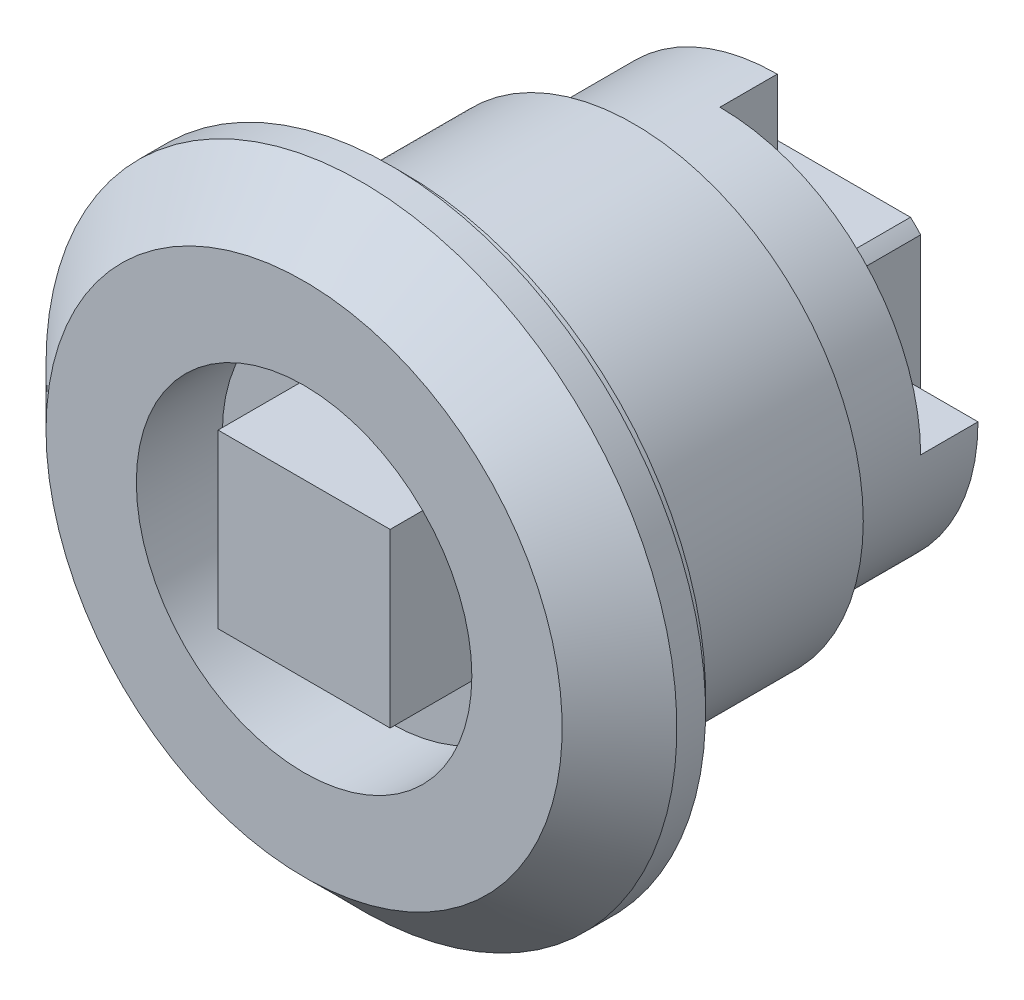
ISO-10303-21;
HEADER;
FILE_DESCRIPTION(('STEP AP214'),'2;1');
FILE_NAME('part.step','',(''),(''),'','','');
FILE_SCHEMA(('AUTOMOTIVE_DESIGN { 1 0 10303 214 1 1 1 1 }'));
ENDSEC;
DATA;
#1=APPLICATION_CONTEXT('core data for automotive mechanical design processes');
#2=APPLICATION_PROTOCOL_DEFINITION('international standard','automotive_design',2000,#1);
#3=PRODUCT_CONTEXT('',#1,'mechanical');
#4=PRODUCT('Part','Part','',(#3));
#5=PRODUCT_RELATED_PRODUCT_CATEGORY('part','',(#4));
#6=PRODUCT_DEFINITION_FORMATION('','',#4);
#7=PRODUCT_DEFINITION_CONTEXT('part definition',#1,'design');
#8=PRODUCT_DEFINITION('design','',#6,#7);
#9=PRODUCT_DEFINITION_SHAPE('','',#8);
#10=(LENGTH_UNIT() NAMED_UNIT(*) SI_UNIT(.MILLI.,.METRE.));
#11=(NAMED_UNIT(*) PLANE_ANGLE_UNIT() SI_UNIT($,.RADIAN.));
#12=(NAMED_UNIT(*) SI_UNIT($,.STERADIAN.) SOLID_ANGLE_UNIT());
#13=UNCERTAINTY_MEASURE_WITH_UNIT(LENGTH_MEASURE(1.E-05),#10,'distance_accuracy_value','');
#14=(GEOMETRIC_REPRESENTATION_CONTEXT(3) GLOBAL_UNCERTAINTY_ASSIGNED_CONTEXT((#13)) GLOBAL_UNIT_ASSIGNED_CONTEXT((#10,
#11,#12)) REPRESENTATION_CONTEXT('',''));
#15=CARTESIAN_POINT('',(0.,0.,0.));
#16=DIRECTION('',(0.,0.,1.));
#17=DIRECTION('',(1.,0.,0.));
#18=AXIS2_PLACEMENT_3D('',#15,#16,#17);
#19=CARTESIAN_POINT('',(0.,0.,-50.));
#20=DIRECTION('',(0.,0.,-1.));
#21=DIRECTION('',(-1.,0.,0.));
#22=AXIS2_PLACEMENT_3D('',#19,#20,#21);
#23=CYLINDRICAL_SURFACE('',#22,4.);
#24=DIRECTION('',(0.,0.,-1.));
#25=VECTOR('',#24,1.);
#26=CARTESIAN_POINT('',(-2.64575131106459,-3.,-7.61483519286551));
#27=LINE('',#26,#25);
#28=CARTESIAN_POINT('',(-2.64575131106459,-3.,-13.));
#29=VERTEX_POINT('',#28);
#30=CARTESIAN_POINT('',(-2.64575131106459,-3.,-15.));
#31=VERTEX_POINT('',#30);
#32=EDGE_CURVE('E204',#29,#31,#27,.T.);
#33=ORIENTED_EDGE('',*,*,#32,.F.);
#34=CARTESIAN_POINT('',(0.,0.,-13.));
#35=DIRECTION('',(0.,0.,-1.));
#36=DIRECTION('',(-1.,0.,0.));
#37=AXIS2_PLACEMENT_3D('',#34,#35,#36);
#38=CIRCLE('',#37,4.);
#39=CARTESIAN_POINT('',(-3.,-2.6457513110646,-13.));
#40=VERTEX_POINT('',#39);
#41=EDGE_CURVE('E264',#29,#40,#38,.T.);
#42=ORIENTED_EDGE('',*,*,#41,.T.);
#43=DIRECTION('',(0.,0.,-1.));
#44=VECTOR('',#43,1.);
#45=CARTESIAN_POINT('',(-3.,-2.6457513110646,-7.61483519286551));
#46=LINE('',#45,#44);
#47=CARTESIAN_POINT('',(-3.,-2.6457513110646,-15.));
#48=VERTEX_POINT('',#47);
#49=EDGE_CURVE('E229',#40,#48,#46,.T.);
#50=ORIENTED_EDGE('',*,*,#49,.T.);
#51=CARTESIAN_POINT('',(0.,0.,-15.));
#52=DIRECTION('',(0.,0.,-1.));
#53=DIRECTION('',(-1.,0.,0.));
#54=AXIS2_PLACEMENT_3D('',#51,#52,#53);
#55=CIRCLE('',#54,4.);
#56=EDGE_CURVE('E258',#31,#48,#55,.T.);
#57=ORIENTED_EDGE('',*,*,#56,.F.);
#58=EDGE_LOOP('',(#33,#42,#50,#57));
#59=FACE_BOUND('',#58,.T.);
#60=ADVANCED_FACE('F14',(#59),#23,.T.);
#61=DIRECTION('',(0.,0.,-1.));
#62=VECTOR('',#61,1.);
#63=CARTESIAN_POINT('',(2.64575131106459,-3.,-7.61483519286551));
#64=LINE('',#63,#62);
#65=CARTESIAN_POINT('',(2.64575131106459,-3.,-13.));
#66=VERTEX_POINT('',#65);
#67=CARTESIAN_POINT('',(2.64575131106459,-3.,-15.));
#68=VERTEX_POINT('',#67);
#69=EDGE_CURVE('E209',#66,#68,#64,.T.);
#70=ORIENTED_EDGE('',*,*,#69,.T.);
#71=CARTESIAN_POINT('',(3.,-2.64575131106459,-15.));
#72=VERTEX_POINT('',#71);
#73=EDGE_CURVE('E254',#72,#68,#55,.T.);
#74=ORIENTED_EDGE('',*,*,#73,.F.);
#75=DIRECTION('',(0.,0.,-1.));
#76=VECTOR('',#75,1.);
#77=CARTESIAN_POINT('',(3.,-2.64575131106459,-7.61483519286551));
#78=LINE('',#77,#76);
#79=CARTESIAN_POINT('',(3.,-2.64575131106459,-13.));
#80=VERTEX_POINT('',#79);
#81=EDGE_CURVE('E234',#80,#72,#78,.T.);
#82=ORIENTED_EDGE('',*,*,#81,.F.);
#83=EDGE_CURVE('E260',#80,#66,#38,.T.);
#84=ORIENTED_EDGE('',*,*,#83,.T.);
#85=EDGE_LOOP('',(#70,#74,#82,#84));
#86=FACE_BOUND('',#85,.T.);
#87=ADVANCED_FACE('F295',(#86),#23,.T.);
#88=CARTESIAN_POINT('',(0.,4.,-15.));
#89=DIRECTION('',(0.,0.,1.));
#90=DIRECTION('',(1.,0.,0.));
#91=AXIS2_PLACEMENT_3D('',#88,#89,#90);
#92=PLANE('',#91);
#93=CARTESIAN_POINT('',(0.,0.,-15.));
#94=DIRECTION('',(0.,0.,-1.));
#95=DIRECTION('',(-1.,0.,0.));
#96=AXIS2_PLACEMENT_3D('',#93,#94,#95);
#97=CIRCLE('',#96,2.5);
#98=CARTESIAN_POINT('',(-2.5,0.,-15.));
#99=VERTEX_POINT('',#98);
#100=EDGE_CURVE('E198',#99,#99,#97,.T.);
#101=ORIENTED_EDGE('',*,*,#100,.F.);
#102=EDGE_LOOP('',(#101));
#103=FACE_BOUND('',#102,.T.);
#104=DIRECTION('',(-1.,0.,0.));
#105=VECTOR('',#104,1.);
#106=CARTESIAN_POINT('',(2.64575131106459,-3.,-15.));
#107=LINE('',#106,#105);
#108=EDGE_CURVE('E205',#68,#31,#107,.T.);
#109=ORIENTED_EDGE('',*,*,#108,.T.);
#110=ORIENTED_EDGE('',*,*,#56,.T.);
#111=DIRECTION('',(0.,-1.,0.));
#112=VECTOR('',#111,1.);
#113=CARTESIAN_POINT('',(-3.,2.64575131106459,-15.));
#114=LINE('',#113,#112);
#115=CARTESIAN_POINT('',(-3.,2.64575131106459,-15.));
#116=VERTEX_POINT('',#115);
#117=EDGE_CURVE('E223',#116,#48,#114,.T.);
#118=ORIENTED_EDGE('',*,*,#117,.F.);
#119=CARTESIAN_POINT('',(-2.64575131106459,3.,-15.));
#120=VERTEX_POINT('',#119);
#121=EDGE_CURVE('E259',#116,#120,#55,.T.);
#122=ORIENTED_EDGE('',*,*,#121,.T.);
#123=DIRECTION('',(-1.,0.,0.));
#124=VECTOR('',#123,1.);
#125=CARTESIAN_POINT('',(2.64575131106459,3.,-15.));
#126=LINE('',#125,#124);
#127=CARTESIAN_POINT('',(2.64575131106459,3.,-15.));
#128=VERTEX_POINT('',#127);
#129=EDGE_CURVE('E211',#128,#120,#126,.T.);
#130=ORIENTED_EDGE('',*,*,#129,.F.);
#131=CARTESIAN_POINT('',(3.,2.64575131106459,-15.));
#132=VERTEX_POINT('',#131);
#133=EDGE_CURVE('E253',#128,#132,#55,.T.);
#134=ORIENTED_EDGE('',*,*,#133,.T.);
#135=DIRECTION('',(0.,-1.,0.));
#136=VECTOR('',#135,1.);
#137=CARTESIAN_POINT('',(3.,2.64575131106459,-15.));
#138=LINE('',#137,#136);
#139=EDGE_CURVE('E235',#132,#72,#138,.T.);
#140=ORIENTED_EDGE('',*,*,#139,.T.);
#141=ORIENTED_EDGE('',*,*,#73,.T.);
#142=EDGE_LOOP('',(#109,#110,#118,#122,#130,#134,#140,#141));
#143=FACE_BOUND('',#142,.T.);
#144=ADVANCED_FACE('F302',(#103,#143),#92,.F.);
#145=CARTESIAN_POINT('',(-3.,2.64575131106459,-13.));
#146=VERTEX_POINT('',#145);
#147=CARTESIAN_POINT('',(-2.64575131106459,3.,-13.));
#148=VERTEX_POINT('',#147);
#149=EDGE_CURVE('E257',#146,#148,#38,.T.);
#150=ORIENTED_EDGE('',*,*,#149,.T.);
#151=DIRECTION('',(0.,0.,-1.));
#152=VECTOR('',#151,1.);
#153=CARTESIAN_POINT('',(-2.64575131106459,3.,-7.61483519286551));
#154=LINE('',#153,#152);
#155=EDGE_CURVE('E218',#148,#120,#154,.T.);
#156=ORIENTED_EDGE('',*,*,#155,.T.);
#157=ORIENTED_EDGE('',*,*,#121,.F.);
#158=DIRECTION('',(0.,0.,-1.));
#159=VECTOR('',#158,1.);
#160=CARTESIAN_POINT('',(-3.,2.64575131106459,-7.61483519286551));
#161=LINE('',#160,#159);
#162=EDGE_CURVE('E232',#146,#116,#161,.T.);
#163=ORIENTED_EDGE('',*,*,#162,.F.);
#164=EDGE_LOOP('',(#150,#156,#157,#163));
#165=FACE_BOUND('',#164,.T.);
#166=ADVANCED_FACE('F304',(#165),#23,.T.);
#167=ORIENTED_EDGE('',*,*,#133,.F.);
#168=DIRECTION('',(0.,0.,-1.));
#169=VECTOR('',#168,1.);
#170=CARTESIAN_POINT('',(2.64575131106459,3.,-7.61483519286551));
#171=LINE('',#170,#169);
#172=CARTESIAN_POINT('',(2.64575131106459,3.,-13.));
#173=VERTEX_POINT('',#172);
#174=EDGE_CURVE('E221',#173,#128,#171,.T.);
#175=ORIENTED_EDGE('',*,*,#174,.F.);
#176=CARTESIAN_POINT('',(0.,0.,-13.));
#177=DIRECTION('',(0.,0.,-1.));
#178=DIRECTION('',(-1.,0.,0.));
#179=AXIS2_PLACEMENT_3D('',#176,#177,#178);
#180=CIRCLE('',#179,4.);
#181=CARTESIAN_POINT('',(0.,4.,-13.));
#182=VERTEX_POINT('',#181);
#183=EDGE_CURVE('E176',#182,#173,#180,.T.);
#184=ORIENTED_EDGE('',*,*,#183,.F.);
#185=DIRECTION('',(0.,0.,-1.));
#186=VECTOR('',#185,1.);
#187=CARTESIAN_POINT('',(0.,4.,-11.));
#188=LINE('',#187,#186);
#189=CARTESIAN_POINT('',(0.,4.,-11.));
#190=VERTEX_POINT('',#189);
#191=EDGE_CURVE('E193',#190,#182,#188,.T.);
#192=ORIENTED_EDGE('',*,*,#191,.F.);
#193=CARTESIAN_POINT('',(0.,0.,-11.));
#194=DIRECTION('',(0.,0.,-1.));
#195=DIRECTION('',(-1.,0.,0.));
#196=AXIS2_PLACEMENT_3D('',#193,#194,#195);
#197=CIRCLE('',#196,4.);
#198=CARTESIAN_POINT('',(4.,0.,-11.));
#199=VERTEX_POINT('',#198);
#200=EDGE_CURVE('E184',#190,#199,#197,.T.);
#201=ORIENTED_EDGE('',*,*,#200,.T.);
#202=DIRECTION('',(0.,0.,-1.));
#203=VECTOR('',#202,1.);
#204=CARTESIAN_POINT('',(4.,0.,-11.));
#205=LINE('',#204,#203);
#206=CARTESIAN_POINT('',(4.,0.,-13.));
#207=VERTEX_POINT('',#206);
#208=EDGE_CURVE('E191',#199,#207,#205,.T.);
#209=ORIENTED_EDGE('',*,*,#208,.T.);
#210=CARTESIAN_POINT('',(3.,2.64575131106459,-13.));
#211=VERTEX_POINT('',#210);
#212=EDGE_CURVE('E175',#211,#207,#180,.T.);
#213=ORIENTED_EDGE('',*,*,#212,.F.);
#214=DIRECTION('',(0.,0.,-1.));
#215=VECTOR('',#214,1.);
#216=CARTESIAN_POINT('',(3.,2.64575131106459,-7.61483519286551));
#217=LINE('',#216,#215);
#218=EDGE_CURVE('E239',#211,#132,#217,.T.);
#219=ORIENTED_EDGE('',*,*,#218,.T.);
#220=EDGE_LOOP('',(#167,#175,#184,#192,#201,#209,#213,#219));
#221=FACE_BOUND('',#220,.T.);
#222=ADVANCED_FACE('F292',(#221),#23,.T.);
#223=CARTESIAN_POINT('',(0.,11.,0.5));
#224=DIRECTION('',(0.,0.,1.));
#225=DIRECTION('',(1.,0.,0.));
#226=AXIS2_PLACEMENT_3D('',#223,#224,#225);
#227=PLANE('',#226);
#228=CARTESIAN_POINT('',(0.,0.,0.5));
#229=DIRECTION('',(0.,0.,-1.));
#230=DIRECTION('',(-1.,0.,0.));
#231=AXIS2_PLACEMENT_3D('',#228,#229,#230);
#232=CIRCLE('',#231,10.5);
#233=CARTESIAN_POINT('',(-10.5,0.,0.5));
#234=VERTEX_POINT('',#233);
#235=EDGE_CURVE('E9',#234,#234,#232,.T.);
#236=ORIENTED_EDGE('',*,*,#235,.F.);
#237=EDGE_LOOP('',(#236));
#238=FACE_BOUND('',#237,.T.);
#239=CARTESIAN_POINT('',(0.,0.,0.5));
#240=DIRECTION('',(0.,0.,-1.));
#241=DIRECTION('',(-1.,0.,0.));
#242=AXIS2_PLACEMENT_3D('',#239,#240,#241);
#243=CIRCLE('',#242,11.);
#244=CARTESIAN_POINT('',(-11.,0.,0.5));
#245=VERTEX_POINT('',#244);
#246=EDGE_CURVE('E241',#245,#245,#243,.T.);
#247=ORIENTED_EDGE('',*,*,#246,.T.);
#248=EDGE_LOOP('',(#247));
#249=FACE_BOUND('',#248,.T.);
#250=ADVANCED_FACE('F16',(#238,#249),#227,.F.);
#251=CARTESIAN_POINT('',(0.,0.,-50.));
#252=DIRECTION('',(0.,0.,-1.));
#253=DIRECTION('',(-1.,0.,0.));
#254=AXIS2_PLACEMENT_3D('',#251,#252,#253);
#255=CYLINDRICAL_SURFACE('',#254,10.5);
#256=ORIENTED_EDGE('',*,*,#235,.T.);
#257=EDGE_LOOP('',(#256));
#258=FACE_BOUND('',#257,.T.);
#259=CARTESIAN_POINT('',(0.,0.,0.));
#260=DIRECTION('',(0.,0.,-1.));
#261=DIRECTION('',(-1.,0.,0.));
#262=AXIS2_PLACEMENT_3D('',#259,#260,#261);
#263=CIRCLE('',#262,10.5);
#264=CARTESIAN_POINT('',(-10.5,0.,0.));
#265=VERTEX_POINT('',#264);
#266=EDGE_CURVE('E22',#265,#265,#263,.T.);
#267=ORIENTED_EDGE('',*,*,#266,.F.);
#268=EDGE_LOOP('',(#267));
#269=FACE_BOUND('',#268,.T.);
#270=ADVANCED_FACE('F280',(#258,#269),#255,.T.);
#271=CARTESIAN_POINT('',(0.,10.5,0.));
#272=DIRECTION('',(0.,0.,1.));
#273=DIRECTION('',(1.,0.,0.));
#274=AXIS2_PLACEMENT_3D('',#271,#272,#273);
#275=PLANE('',#274);
#276=CARTESIAN_POINT('',(0.,0.,0.));
#277=DIRECTION('',(0.,0.,-1.));
#278=DIRECTION('',(-1.,0.,0.));
#279=AXIS2_PLACEMENT_3D('',#276,#277,#278);
#280=CIRCLE('',#279,8.);
#281=CARTESIAN_POINT('',(-8.,0.,0.));
#282=VERTEX_POINT('',#281);
#283=EDGE_CURVE('E273',#282,#282,#280,.T.);
#284=ORIENTED_EDGE('',*,*,#283,.F.);
#285=EDGE_LOOP('',(#284));
#286=FACE_BOUND('',#285,.T.);
#287=ORIENTED_EDGE('',*,*,#266,.T.);
#288=EDGE_LOOP('',(#287));
#289=FACE_BOUND('',#288,.T.);
#290=ADVANCED_FACE('F278',(#286,#289),#275,.F.);
#291=CARTESIAN_POINT('',(0.,0.,-50.));
#292=DIRECTION('',(0.,0.,-1.));
#293=DIRECTION('',(-1.,0.,0.));
#294=AXIS2_PLACEMENT_3D('',#291,#292,#293);
#295=CYLINDRICAL_SURFACE('',#294,8.);
#296=ORIENTED_EDGE('',*,*,#283,.T.);
#297=EDGE_LOOP('',(#296));
#298=FACE_BOUND('',#297,.T.);
#299=CARTESIAN_POINT('',(0.,0.,-8.));
#300=DIRECTION('',(0.,0.,-1.));
#301=DIRECTION('',(-1.,0.,0.));
#302=AXIS2_PLACEMENT_3D('',#299,#300,#301);
#303=CIRCLE('',#302,8.);
#304=CARTESIAN_POINT('',(-8.,0.,-8.));
#305=VERTEX_POINT('',#304);
#306=EDGE_CURVE('E270',#305,#305,#303,.T.);
#307=ORIENTED_EDGE('',*,*,#306,.F.);
#308=EDGE_LOOP('',(#307));
#309=FACE_BOUND('',#308,.T.);
#310=ADVANCED_FACE('F289',(#298,#309),#295,.T.);
#311=CARTESIAN_POINT('',(0.,8.,-8.));
#312=DIRECTION('',(0.,0.,1.));
#313=DIRECTION('',(1.,0.,0.));
#314=AXIS2_PLACEMENT_3D('',#311,#312,#313);
#315=PLANE('',#314);
#316=CARTESIAN_POINT('',(0.,0.,-8.));
#317=DIRECTION('',(0.,0.,-1.));
#318=DIRECTION('',(-1.,0.,0.));
#319=AXIS2_PLACEMENT_3D('',#316,#317,#318);
#320=CIRCLE('',#319,7.);
#321=CARTESIAN_POINT('',(-7.,0.,-8.));
#322=VERTEX_POINT('',#321);
#323=EDGE_CURVE('E267',#322,#322,#320,.T.);
#324=ORIENTED_EDGE('',*,*,#323,.F.);
#325=EDGE_LOOP('',(#324));
#326=FACE_BOUND('',#325,.T.);
#327=ORIENTED_EDGE('',*,*,#306,.T.);
#328=EDGE_LOOP('',(#327));
#329=FACE_BOUND('',#328,.T.);
#330=ADVANCED_FACE('F585',(#326,#329),#315,.F.);
#331=CARTESIAN_POINT('',(0.,0.,-50.));
#332=DIRECTION('',(0.,0.,-1.));
#333=DIRECTION('',(-1.,0.,0.));
#334=AXIS2_PLACEMENT_3D('',#331,#332,#333);
#335=CYLINDRICAL_SURFACE('',#334,7.);
#336=CARTESIAN_POINT('',(0.,0.,-11.));
#337=DIRECTION('',(0.,0.,-1.));
#338=DIRECTION('',(-1.,0.,0.));
#339=AXIS2_PLACEMENT_3D('',#336,#337,#338);
#340=CIRCLE('',#339,7.);
#341=CARTESIAN_POINT('',(0.,7.,-11.));
#342=VERTEX_POINT('',#341);
#343=CARTESIAN_POINT('',(7.,0.,-11.));
#344=VERTEX_POINT('',#343);
#345=EDGE_CURVE('E180',#342,#344,#340,.T.);
#346=ORIENTED_EDGE('',*,*,#345,.F.);
#347=DIRECTION('',(0.,0.,-1.));
#348=VECTOR('',#347,1.);
#349=CARTESIAN_POINT('',(0.,7.,-11.));
#350=LINE('',#349,#348);
#351=CARTESIAN_POINT('',(0.,7.,-13.));
#352=VERTEX_POINT('',#351);
#353=EDGE_CURVE('E195',#342,#352,#350,.T.);
#354=ORIENTED_EDGE('',*,*,#353,.T.);
#355=CARTESIAN_POINT('',(0.,0.,-13.));
#356=DIRECTION('',(0.,0.,-1.));
#357=DIRECTION('',(-1.,0.,0.));
#358=AXIS2_PLACEMENT_3D('',#355,#356,#357);
#359=CIRCLE('',#358,7.);
#360=CARTESIAN_POINT('',(7.,0.,-13.));
#361=VERTEX_POINT('',#360);
#362=EDGE_CURVE('E263',#361,#352,#359,.T.);
#363=ORIENTED_EDGE('',*,*,#362,.F.);
#364=DIRECTION('',(0.,0.,-1.));
#365=VECTOR('',#364,1.);
#366=CARTESIAN_POINT('',(7.,0.,-11.));
#367=LINE('',#366,#365);
#368=EDGE_CURVE('E37',#344,#361,#367,.T.);
#369=ORIENTED_EDGE('',*,*,#368,.F.);
#370=EDGE_LOOP('',(#346,#354,#363,#369));
#371=FACE_BOUND('',#370,.T.);
#372=ORIENTED_EDGE('',*,*,#323,.T.);
#373=EDGE_LOOP('',(#372));
#374=FACE_BOUND('',#373,.T.);
#375=ADVANCED_FACE('F350',(#371,#374),#335,.T.);
#376=CARTESIAN_POINT('',(0.,7.,-13.));
#377=DIRECTION('',(0.,0.,1.));
#378=DIRECTION('',(1.,0.,0.));
#379=AXIS2_PLACEMENT_3D('',#376,#377,#378);
#380=PLANE('',#379);
#381=ORIENTED_EDGE('',*,*,#362,.T.);
#382=DIRECTION('',(0.,1.,0.));
#383=VECTOR('',#382,1.);
#384=CARTESIAN_POINT('',(0.,4.,-13.));
#385=LINE('',#384,#383);
#386=EDGE_CURVE('E178',#182,#352,#385,.T.);
#387=ORIENTED_EDGE('',*,*,#386,.F.);
#388=ORIENTED_EDGE('',*,*,#183,.T.);
#389=DIRECTION('',(-1.,0.,0.));
#390=VECTOR('',#389,1.);
#391=CARTESIAN_POINT('',(2.64575131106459,3.,-13.));
#392=LINE('',#391,#390);
#393=EDGE_CURVE('E216',#173,#148,#392,.T.);
#394=ORIENTED_EDGE('',*,*,#393,.T.);
#395=ORIENTED_EDGE('',*,*,#149,.F.);
#396=DIRECTION('',(0.,-1.,0.));
#397=VECTOR('',#396,1.);
#398=CARTESIAN_POINT('',(-3.,2.64575131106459,-13.));
#399=LINE('',#398,#397);
#400=EDGE_CURVE('E226',#146,#40,#399,.T.);
#401=ORIENTED_EDGE('',*,*,#400,.T.);
#402=ORIENTED_EDGE('',*,*,#41,.F.);
#403=DIRECTION('',(-1.,0.,0.));
#404=VECTOR('',#403,1.);
#405=CARTESIAN_POINT('',(2.64575131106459,-3.,-13.));
#406=LINE('',#405,#404);
#407=EDGE_CURVE('E208',#66,#29,#406,.T.);
#408=ORIENTED_EDGE('',*,*,#407,.F.);
#409=ORIENTED_EDGE('',*,*,#83,.F.);
#410=DIRECTION('',(0.,-1.,0.));
#411=VECTOR('',#410,1.);
#412=CARTESIAN_POINT('',(3.,2.64575131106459,-13.));
#413=LINE('',#412,#411);
#414=EDGE_CURVE('E238',#211,#80,#413,.T.);
#415=ORIENTED_EDGE('',*,*,#414,.F.);
#416=ORIENTED_EDGE('',*,*,#212,.T.);
#417=DIRECTION('',(1.,0.,0.));
#418=VECTOR('',#417,1.);
#419=CARTESIAN_POINT('',(4.,0.,-13.));
#420=LINE('',#419,#418);
#421=EDGE_CURVE('E173',#207,#361,#420,.T.);
#422=ORIENTED_EDGE('',*,*,#421,.T.);
#423=EDGE_LOOP('',(#381,#387,#388,#394,#395,#401,#402,#408,#409,#415,#416,#422));
#424=FACE_BOUND('',#423,.T.);
#425=ADVANCED_FACE('F333',(#424),#380,.F.);
#426=CARTESIAN_POINT('',(0.,9.,3.5));
#427=DIRECTION('',(0.,0.,1.));
#428=DIRECTION('',(1.,0.,0.));
#429=AXIS2_PLACEMENT_3D('',#426,#427,#428);
#430=PLANE('',#429);
#431=CARTESIAN_POINT('',(0.,0.,3.5));
#432=DIRECTION('',(0.,0.,1.));
#433=DIRECTION('',(1.,0.,0.));
#434=AXIS2_PLACEMENT_3D('',#431,#432,#433);
#435=CIRCLE('',#434,5.85);
#436=CARTESIAN_POINT('',(5.85,0.,3.5));
#437=VERTEX_POINT('',#436);
#438=EDGE_CURVE('E167',#437,#437,#435,.T.);
#439=ORIENTED_EDGE('',*,*,#438,.F.);
#440=EDGE_LOOP('',(#439));
#441=FACE_BOUND('',#440,.T.);
#442=CARTESIAN_POINT('',(0.,0.,3.5));
#443=DIRECTION('',(0.,0.,-1.));
#444=DIRECTION('',(-1.,0.,0.));
#445=AXIS2_PLACEMENT_3D('',#442,#443,#444);
#446=CIRCLE('',#445,9.);
#447=CARTESIAN_POINT('',(-9.,0.,3.5));
#448=VERTEX_POINT('',#447);
#449=EDGE_CURVE('E250',#448,#448,#446,.T.);
#450=ORIENTED_EDGE('',*,*,#449,.F.);
#451=EDGE_LOOP('',(#450));
#452=FACE_BOUND('',#451,.T.);
#453=ADVANCED_FACE('F417',(#441,#452),#430,.T.);
#454=CARTESIAN_POINT('',(0.,0.,1.5));
#455=DIRECTION('',(0.,0.,-1.));
#456=DIRECTION('',(-1.,0.,0.));
#457=AXIS2_PLACEMENT_3D('',#454,#455,#456);
#458=CONICAL_SURFACE('',#457,11.,0.785398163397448);
#459=ORIENTED_EDGE('',*,*,#449,.T.);
#460=EDGE_LOOP('',(#459));
#461=FACE_BOUND('',#460,.T.);
#462=CARTESIAN_POINT('',(0.,0.,1.5));
#463=DIRECTION('',(0.,0.,-1.));
#464=DIRECTION('',(-1.,0.,0.));
#465=AXIS2_PLACEMENT_3D('',#462,#463,#464);
#466=CIRCLE('',#465,11.);
#467=CARTESIAN_POINT('',(-11.,0.,1.5));
#468=VERTEX_POINT('',#467);
#469=EDGE_CURVE('E247',#468,#468,#466,.T.);
#470=ORIENTED_EDGE('',*,*,#469,.F.);
#471=EDGE_LOOP('',(#470));
#472=FACE_BOUND('',#471,.T.);
#473=ADVANCED_FACE('F420',(#461,#472),#458,.T.);
#474=CARTESIAN_POINT('',(0.,0.,-50.));
#475=DIRECTION('',(0.,0.,-1.));
#476=DIRECTION('',(-1.,0.,0.));
#477=AXIS2_PLACEMENT_3D('',#474,#475,#476);
#478=CYLINDRICAL_SURFACE('',#477,11.);
#479=ORIENTED_EDGE('',*,*,#469,.T.);
#480=EDGE_LOOP('',(#479));
#481=FACE_BOUND('',#480,.T.);
#482=ORIENTED_EDGE('',*,*,#246,.F.);
#483=EDGE_LOOP('',(#482));
#484=FACE_BOUND('',#483,.T.);
#485=ADVANCED_FACE('F426',(#481,#484),#478,.T.);
#486=CARTESIAN_POINT('',(3.,2.64575131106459,-7.61483519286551));
#487=DIRECTION('',(1.,0.,0.));
#488=DIRECTION('',(0.,1.,0.));
#489=AXIS2_PLACEMENT_3D('',#486,#487,#488);
#490=PLANE('',#489);
#491=ORIENTED_EDGE('',*,*,#414,.T.);
#492=ORIENTED_EDGE('',*,*,#81,.T.);
#493=ORIENTED_EDGE('',*,*,#139,.F.);
#494=ORIENTED_EDGE('',*,*,#218,.F.);
#495=EDGE_LOOP('',(#491,#492,#493,#494));
#496=FACE_BOUND('',#495,.T.);
#497=ADVANCED_FACE('F356',(#496),#490,.T.);
#498=CARTESIAN_POINT('',(-3.,2.64575131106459,-7.61483519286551));
#499=DIRECTION('',(1.,0.,0.));
#500=DIRECTION('',(0.,1.,0.));
#501=AXIS2_PLACEMENT_3D('',#498,#499,#500);
#502=PLANE('',#501);
#503=ORIENTED_EDGE('',*,*,#162,.T.);
#504=ORIENTED_EDGE('',*,*,#117,.T.);
#505=ORIENTED_EDGE('',*,*,#49,.F.);
#506=ORIENTED_EDGE('',*,*,#400,.F.);
#507=EDGE_LOOP('',(#503,#504,#505,#506));
#508=FACE_BOUND('',#507,.T.);
#509=ADVANCED_FACE('F328',(#508),#502,.F.);
#510=CARTESIAN_POINT('',(2.64575131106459,3.,-7.61483519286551));
#511=DIRECTION('',(0.,-1.,0.));
#512=DIRECTION('',(1.,0.,0.));
#513=AXIS2_PLACEMENT_3D('',#510,#511,#512);
#514=PLANE('',#513);
#515=ORIENTED_EDGE('',*,*,#174,.T.);
#516=ORIENTED_EDGE('',*,*,#129,.T.);
#517=ORIENTED_EDGE('',*,*,#155,.F.);
#518=ORIENTED_EDGE('',*,*,#393,.F.);
#519=EDGE_LOOP('',(#515,#516,#517,#518));
#520=FACE_BOUND('',#519,.T.);
#521=ADVANCED_FACE('F337',(#520),#514,.F.);
#522=CARTESIAN_POINT('',(2.64575131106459,-3.,-7.61483519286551));
#523=DIRECTION('',(0.,-1.,0.));
#524=DIRECTION('',(1.,0.,0.));
#525=AXIS2_PLACEMENT_3D('',#522,#523,#524);
#526=PLANE('',#525);
#527=ORIENTED_EDGE('',*,*,#407,.T.);
#528=ORIENTED_EDGE('',*,*,#32,.T.);
#529=ORIENTED_EDGE('',*,*,#108,.F.);
#530=ORIENTED_EDGE('',*,*,#69,.F.);
#531=EDGE_LOOP('',(#527,#528,#529,#530));
#532=FACE_BOUND('',#531,.T.);
#533=ADVANCED_FACE('F362',(#532),#526,.T.);
#534=CARTESIAN_POINT('',(0.,0.,-7.));
#535=DIRECTION('',(0.,0.,-1.));
#536=DIRECTION('',(-1.,0.,0.));
#537=AXIS2_PLACEMENT_3D('',#534,#535,#536);
#538=CYLINDRICAL_SURFACE('',#537,2.5);
#539=CARTESIAN_POINT('',(0.,0.,-7.));
#540=DIRECTION('',(0.,0.,-1.));
#541=DIRECTION('',(-1.,0.,0.));
#542=AXIS2_PLACEMENT_3D('',#539,#540,#541);
#543=CIRCLE('',#542,2.5);
#544=CARTESIAN_POINT('',(-2.5,0.,-7.));
#545=VERTEX_POINT('',#544);
#546=EDGE_CURVE('E201',#545,#545,#543,.T.);
#547=ORIENTED_EDGE('',*,*,#546,.F.);
#548=EDGE_LOOP('',(#547));
#549=FACE_BOUND('',#548,.T.);
#550=ORIENTED_EDGE('',*,*,#100,.T.);
#551=EDGE_LOOP('',(#550));
#552=FACE_BOUND('',#551,.T.);
#553=ADVANCED_FACE('F364',(#549,#552),#538,.F.);
#554=CARTESIAN_POINT('',(0.,0.,-7.));
#555=DIRECTION('',(0.,0.,-1.));
#556=DIRECTION('',(-1.,0.,0.));
#557=AXIS2_PLACEMENT_3D('',#554,#555,#556);
#558=PLANE('',#557);
#559=ORIENTED_EDGE('',*,*,#546,.T.);
#560=EDGE_LOOP('',(#559));
#561=FACE_BOUND('',#560,.T.);
#562=ADVANCED_FACE('F366',(#561),#558,.T.);
#563=CARTESIAN_POINT('',(0.,4.,-11.));
#564=DIRECTION('',(-1.,0.,0.));
#565=DIRECTION('',(0.,0.,1.));
#566=AXIS2_PLACEMENT_3D('',#563,#564,#565);
#567=PLANE('',#566);
#568=ORIENTED_EDGE('',*,*,#191,.T.);
#569=ORIENTED_EDGE('',*,*,#386,.T.);
#570=ORIENTED_EDGE('',*,*,#353,.F.);
#571=DIRECTION('',(0.,1.,0.));
#572=VECTOR('',#571,1.);
#573=CARTESIAN_POINT('',(0.,4.,-11.));
#574=LINE('',#573,#572);
#575=EDGE_CURVE('E187',#190,#342,#574,.T.);
#576=ORIENTED_EDGE('',*,*,#575,.F.);
#577=EDGE_LOOP('',(#568,#569,#570,#576));
#578=FACE_BOUND('',#577,.T.);
#579=ADVANCED_FACE('F347',(#578),#567,.F.);
#580=CARTESIAN_POINT('',(4.,0.,-11.));
#581=DIRECTION('',(0.,1.,0.));
#582=DIRECTION('',(-1.,0.,0.));
#583=AXIS2_PLACEMENT_3D('',#580,#581,#582);
#584=PLANE('',#583);
#585=DIRECTION('',(1.,0.,0.));
#586=VECTOR('',#585,1.);
#587=CARTESIAN_POINT('',(4.,0.,-11.));
#588=LINE('',#587,#586);
#589=EDGE_CURVE('E182',#199,#344,#588,.T.);
#590=ORIENTED_EDGE('',*,*,#589,.T.);
#591=ORIENTED_EDGE('',*,*,#368,.T.);
#592=ORIENTED_EDGE('',*,*,#421,.F.);
#593=ORIENTED_EDGE('',*,*,#208,.F.);
#594=EDGE_LOOP('',(#590,#591,#592,#593));
#595=FACE_BOUND('',#594,.T.);
#596=ADVANCED_FACE('F354',(#595),#584,.T.);
#597=CARTESIAN_POINT('',(0.,0.,-11.));
#598=DIRECTION('',(0.,0.,-1.));
#599=DIRECTION('',(-1.,0.,0.));
#600=AXIS2_PLACEMENT_3D('',#597,#598,#599);
#601=PLANE('',#600);
#602=ORIENTED_EDGE('',*,*,#345,.T.);
#603=ORIENTED_EDGE('',*,*,#589,.F.);
#604=ORIENTED_EDGE('',*,*,#200,.F.);
#605=ORIENTED_EDGE('',*,*,#575,.T.);
#606=EDGE_LOOP('',(#602,#603,#604,#605));
#607=FACE_BOUND('',#606,.T.);
#608=ADVANCED_FACE('F345',(#607),#601,.T.);
#609=CARTESIAN_POINT('',(0.,0.,0.499999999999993));
#610=DIRECTION('',(0.,0.,1.));
#611=DIRECTION('',(1.,0.,0.));
#612=AXIS2_PLACEMENT_3D('',#609,#610,#611);
#613=CYLINDRICAL_SURFACE('',#612,5.85);
#614=CARTESIAN_POINT('',(0.,0.,0.499999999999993));
#615=DIRECTION('',(0.,0.,1.));
#616=DIRECTION('',(1.,0.,0.));
#617=AXIS2_PLACEMENT_3D('',#614,#615,#616);
#618=CIRCLE('',#617,5.85);
#619=CARTESIAN_POINT('',(5.85,0.,0.499999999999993));
#620=VERTEX_POINT('',#619);
#621=EDGE_CURVE('E170',#620,#620,#618,.T.);
#622=ORIENTED_EDGE('',*,*,#621,.F.);
#623=EDGE_LOOP('',(#622));
#624=FACE_BOUND('',#623,.T.);
#625=ORIENTED_EDGE('',*,*,#438,.T.);
#626=EDGE_LOOP('',(#625));
#627=FACE_BOUND('',#626,.T.);
#628=ADVANCED_FACE('F389',(#624,#627),#613,.F.);
#629=CARTESIAN_POINT('',(0.,0.,0.499999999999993));
#630=DIRECTION('',(0.,0.,1.));
#631=DIRECTION('',(1.,0.,0.));
#632=AXIS2_PLACEMENT_3D('',#629,#630,#631);
#633=PLANE('',#632);
#634=DIRECTION('',(1.,0.,0.));
#635=VECTOR('',#634,1.);
#636=CARTESIAN_POINT('',(-3.,3.,0.499999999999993));
#637=LINE('',#636,#635);
#638=CARTESIAN_POINT('',(-3.,3.,0.499999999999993));
#639=VERTEX_POINT('',#638);
#640=CARTESIAN_POINT('',(3.,3.,0.499999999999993));
#641=VERTEX_POINT('',#640);
#642=EDGE_CURVE('E161',#639,#641,#637,.T.);
#643=ORIENTED_EDGE('',*,*,#642,.T.);
#644=DIRECTION('',(0.,1.,0.));
#645=VECTOR('',#644,1.);
#646=CARTESIAN_POINT('',(3.,-3.,0.499999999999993));
#647=LINE('',#646,#645);
#648=CARTESIAN_POINT('',(3.,-3.,0.499999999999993));
#649=VERTEX_POINT('',#648);
#650=EDGE_CURVE('E131',#649,#641,#647,.T.);
#651=ORIENTED_EDGE('',*,*,#650,.F.);
#652=DIRECTION('',(-1.,0.,0.));
#653=VECTOR('',#652,1.);
#654=CARTESIAN_POINT('',(3.,-3.,0.499999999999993));
#655=LINE('',#654,#653);
#656=CARTESIAN_POINT('',(-3.,-3.,0.499999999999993));
#657=VERTEX_POINT('',#656);
#658=EDGE_CURVE('E157',#649,#657,#655,.T.);
#659=ORIENTED_EDGE('',*,*,#658,.T.);
#660=DIRECTION('',(0.,-1.,0.));
#661=VECTOR('',#660,1.);
#662=CARTESIAN_POINT('',(-3.,3.,0.499999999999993));
#663=LINE('',#662,#661);
#664=EDGE_CURVE('E144',#639,#657,#663,.T.);
#665=ORIENTED_EDGE('',*,*,#664,.F.);
#666=EDGE_LOOP('',(#643,#651,#659,#665));
#667=FACE_BOUND('',#666,.T.);
#668=ORIENTED_EDGE('',*,*,#621,.T.);
#669=EDGE_LOOP('',(#668));
#670=FACE_BOUND('',#669,.T.);
#671=ADVANCED_FACE('F386',(#667,#670),#633,.T.);
#672=CARTESIAN_POINT('',(-3.,3.,0.499999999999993));
#673=DIRECTION('',(-1.,0.,0.));
#674=DIRECTION('',(0.,-1.,0.));
#675=AXIS2_PLACEMENT_3D('',#672,#673,#674);
#676=PLANE('',#675);
#677=DIRECTION('',(0.,0.,1.));
#678=VECTOR('',#677,1.);
#679=CARTESIAN_POINT('',(-3.,3.,0.499999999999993));
#680=LINE('',#679,#678);
#681=CARTESIAN_POINT('',(-3.,3.,3.5));
#682=VERTEX_POINT('',#681);
#683=EDGE_CURVE('E135',#639,#682,#680,.T.);
#684=ORIENTED_EDGE('',*,*,#683,.F.);
#685=ORIENTED_EDGE('',*,*,#664,.T.);
#686=DIRECTION('',(0.,0.,1.));
#687=VECTOR('',#686,1.);
#688=CARTESIAN_POINT('',(-3.,-3.,0.499999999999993));
#689=LINE('',#688,#687);
#690=CARTESIAN_POINT('',(-3.,-3.,3.5));
#691=VERTEX_POINT('',#690);
#692=EDGE_CURVE('E163',#657,#691,#689,.T.);
#693=ORIENTED_EDGE('',*,*,#692,.T.);
#694=DIRECTION('',(0.,-1.,0.));
#695=VECTOR('',#694,1.);
#696=CARTESIAN_POINT('',(-3.,3.,3.5));
#697=LINE('',#696,#695);
#698=EDGE_CURVE('E151',#682,#691,#697,.T.);
#699=ORIENTED_EDGE('',*,*,#698,.F.);
#700=EDGE_LOOP('',(#684,#685,#693,#699));
#701=FACE_BOUND('',#700,.T.);
#702=ADVANCED_FACE('F393',(#701),#676,.T.);
#703=CARTESIAN_POINT('',(-3.,3.,0.499999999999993));
#704=DIRECTION('',(0.,-1.,0.));
#705=DIRECTION('',(1.,0.,0.));
#706=AXIS2_PLACEMENT_3D('',#703,#704,#705);
#707=PLANE('',#706);
#708=DIRECTION('',(0.,0.,1.));
#709=VECTOR('',#708,1.);
#710=CARTESIAN_POINT('',(3.,3.,0.499999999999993));
#711=LINE('',#710,#709);
#712=CARTESIAN_POINT('',(3.,3.,3.5));
#713=VERTEX_POINT('',#712);
#714=EDGE_CURVE('E128',#641,#713,#711,.T.);
#715=ORIENTED_EDGE('',*,*,#714,.F.);
#716=ORIENTED_EDGE('',*,*,#642,.F.);
#717=ORIENTED_EDGE('',*,*,#683,.T.);
#718=DIRECTION('',(1.,0.,0.));
#719=VECTOR('',#718,1.);
#720=CARTESIAN_POINT('',(-3.,3.,3.5));
#721=LINE('',#720,#719);
#722=EDGE_CURVE('E139',#682,#713,#721,.T.);
#723=ORIENTED_EDGE('',*,*,#722,.T.);
#724=EDGE_LOOP('',(#715,#716,#717,#723));
#725=FACE_BOUND('',#724,.T.);
#726=ADVANCED_FACE('F140',(#725),#707,.F.);
#727=CARTESIAN_POINT('',(3.,-3.,0.499999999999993));
#728=DIRECTION('',(1.,0.,0.));
#729=DIRECTION('',(0.,1.,0.));
#730=AXIS2_PLACEMENT_3D('',#727,#728,#729);
#731=PLANE('',#730);
#732=DIRECTION('',(0.,0.,1.));
#733=VECTOR('',#732,1.);
#734=CARTESIAN_POINT('',(3.,-3.,0.499999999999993));
#735=LINE('',#734,#733);
#736=CARTESIAN_POINT('',(3.,-3.,3.5));
#737=VERTEX_POINT('',#736);
#738=EDGE_CURVE('E136',#649,#737,#735,.T.);
#739=ORIENTED_EDGE('',*,*,#738,.F.);
#740=ORIENTED_EDGE('',*,*,#650,.T.);
#741=ORIENTED_EDGE('',*,*,#714,.T.);
#742=DIRECTION('',(0.,1.,0.));
#743=VECTOR('',#742,1.);
#744=CARTESIAN_POINT('',(3.,-3.,3.5));
#745=LINE('',#744,#743);
#746=EDGE_CURVE('E29',#737,#713,#745,.T.);
#747=ORIENTED_EDGE('',*,*,#746,.F.);
#748=EDGE_LOOP('',(#739,#740,#741,#747));
#749=FACE_BOUND('',#748,.T.);
#750=ADVANCED_FACE('F130',(#749),#731,.T.);
#751=CARTESIAN_POINT('',(3.,-3.,0.499999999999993));
#752=DIRECTION('',(0.,1.,0.));
#753=DIRECTION('',(-1.,0.,0.));
#754=AXIS2_PLACEMENT_3D('',#751,#752,#753);
#755=PLANE('',#754);
#756=ORIENTED_EDGE('',*,*,#658,.F.);
#757=ORIENTED_EDGE('',*,*,#738,.T.);
#758=DIRECTION('',(-1.,0.,0.));
#759=VECTOR('',#758,1.);
#760=CARTESIAN_POINT('',(3.,-3.,3.5));
#761=LINE('',#760,#759);
#762=EDGE_CURVE('E149',#737,#691,#761,.T.);
#763=ORIENTED_EDGE('',*,*,#762,.T.);
#764=ORIENTED_EDGE('',*,*,#692,.F.);
#765=EDGE_LOOP('',(#756,#757,#763,#764));
#766=FACE_BOUND('',#765,.T.);
#767=ADVANCED_FACE('F401',(#766),#755,.F.);
#768=ORIENTED_EDGE('',*,*,#722,.F.);
#769=ORIENTED_EDGE('',*,*,#698,.T.);
#770=ORIENTED_EDGE('',*,*,#762,.F.);
#771=ORIENTED_EDGE('',*,*,#746,.T.);
#772=EDGE_LOOP('',(#768,#769,#770,#771));
#773=FACE_BOUND('',#772,.T.);
#774=ADVANCED_FACE('F147',(#773),#430,.T.);
#775=CLOSED_SHELL('',(#60,#87,#144,#166,#222,#250,#270,#290,#310,#330,#375,#425,#453,#473,#485,
#497,#509,#521,#533,#553,#562,#579,#596,#608,#628,#671,#702,#726,#750,#767,#774));
#776=MANIFOLD_SOLID_BREP('B1',#775);
#777=ADVANCED_BREP_SHAPE_REPRESENTATION('',(#18,#776),#14);
#778=SHAPE_DEFINITION_REPRESENTATION(#9,#777);
ENDSEC;
END-ISO-10303-21;
